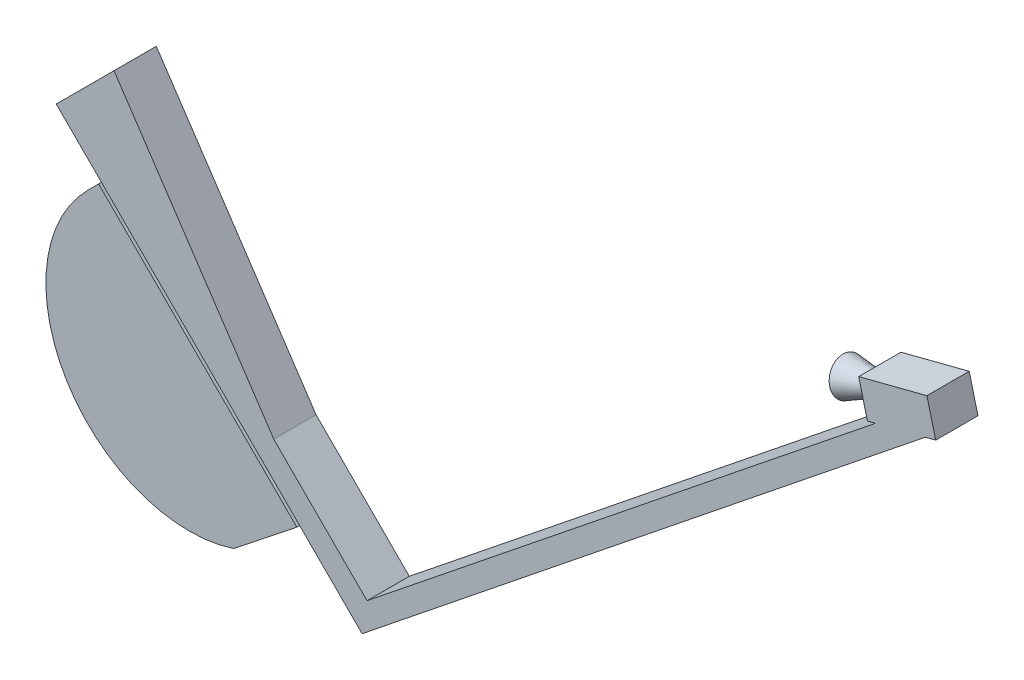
ISO-10303-21;
HEADER;
FILE_DESCRIPTION(('STEP AP214'),'2;1');
FILE_NAME('part.step','',(''),(''),'','','');
FILE_SCHEMA(('AUTOMOTIVE_DESIGN { 1 0 10303 214 1 1 1 1 }'));
ENDSEC;
DATA;
#1=APPLICATION_CONTEXT('core data for automotive mechanical design processes');
#2=APPLICATION_PROTOCOL_DEFINITION('international standard','automotive_design',2000,#1);
#3=PRODUCT_CONTEXT('',#1,'mechanical');
#4=PRODUCT('Part','Part','',(#3));
#5=PRODUCT_RELATED_PRODUCT_CATEGORY('part','',(#4));
#6=PRODUCT_DEFINITION_FORMATION('','',#4);
#7=PRODUCT_DEFINITION_CONTEXT('part definition',#1,'design');
#8=PRODUCT_DEFINITION('design','',#6,#7);
#9=PRODUCT_DEFINITION_SHAPE('','',#8);
#10=(LENGTH_UNIT() NAMED_UNIT(*) SI_UNIT(.MILLI.,.METRE.));
#11=(NAMED_UNIT(*) PLANE_ANGLE_UNIT() SI_UNIT($,.RADIAN.));
#12=(NAMED_UNIT(*) SI_UNIT($,.STERADIAN.) SOLID_ANGLE_UNIT());
#13=UNCERTAINTY_MEASURE_WITH_UNIT(LENGTH_MEASURE(1.E-05),#10,'distance_accuracy_value','');
#14=(GEOMETRIC_REPRESENTATION_CONTEXT(3) GLOBAL_UNCERTAINTY_ASSIGNED_CONTEXT((#13)) GLOBAL_UNIT_ASSIGNED_CONTEXT((#10,
#11,#12)) REPRESENTATION_CONTEXT('',''));
#15=CARTESIAN_POINT('',(0.,0.,0.));
#16=DIRECTION('',(0.,0.,1.));
#17=DIRECTION('',(1.,0.,0.));
#18=AXIS2_PLACEMENT_3D('',#15,#16,#17);
#19=CARTESIAN_POINT('',(-310.477036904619,245.573361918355,43.1));
#20=DIRECTION('',(-0.707106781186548,-0.707106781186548,0.));
#21=DIRECTION('',(0.707106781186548,-0.707106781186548,0.));
#22=AXIS2_PLACEMENT_3D('',#19,#20,#21);
#23=PLANE('',#22);
#24=DIRECTION('',(-0.707106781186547,0.707106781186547,0.));
#25=VECTOR('',#24,1.);
#26=CARTESIAN_POINT('',(-310.477036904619,245.573361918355,38.1));
#27=LINE('',#26,#25);
#28=CARTESIAN_POINT('',(46.638646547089,-111.542321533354,38.1));
#29=VERTEX_POINT('',#28);
#30=CARTESIAN_POINT('',(-310.477036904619,245.573361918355,38.1));
#31=VERTEX_POINT('',#30);
#32=EDGE_CURVE('E116',#29,#31,#27,.T.);
#33=ORIENTED_EDGE('',*,*,#32,.T.);
#34=DIRECTION('',(0.,0.,-1.));
#35=VECTOR('',#34,1.);
#36=CARTESIAN_POINT('',(-310.477036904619,245.573361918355,43.1));
#37=LINE('',#36,#35);
#38=CARTESIAN_POINT('',(-310.477036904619,245.573361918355,43.1));
#39=VERTEX_POINT('',#38);
#40=EDGE_CURVE('E12',#39,#31,#37,.T.);
#41=ORIENTED_EDGE('',*,*,#40,.F.);
#42=DIRECTION('',(-0.707106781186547,0.707106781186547,0.));
#43=VECTOR('',#42,1.);
#44=CARTESIAN_POINT('',(-310.477036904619,245.573361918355,43.1));
#45=LINE('',#44,#43);
#46=CARTESIAN_POINT('',(46.638646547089,-111.542321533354,43.1));
#47=VERTEX_POINT('',#46);
#48=EDGE_CURVE('E104',#47,#39,#45,.T.);
#49=ORIENTED_EDGE('',*,*,#48,.F.);
#50=DIRECTION('',(0.,0.,-1.));
#51=VECTOR('',#50,1.);
#52=CARTESIAN_POINT('',(46.638646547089,-111.542321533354,43.1));
#53=LINE('',#52,#51);
#54=EDGE_CURVE('E112',#47,#29,#53,.T.);
#55=ORIENTED_EDGE('',*,*,#54,.T.);
#56=EDGE_LOOP('',(#33,#41,#49,#55));
#57=FACE_BOUND('',#56,.T.);
#58=ADVANCED_FACE('F53',(#57),#23,.F.);
#59=CARTESIAN_POINT('',(-310.477036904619,245.573361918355,43.1));
#60=DIRECTION('',(0.707106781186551,-0.707106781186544,0.));
#61=DIRECTION('',(0.707106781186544,0.707106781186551,0.));
#62=AXIS2_PLACEMENT_3D('',#59,#60,#61);
#63=PLANE('',#62);
#64=DIRECTION('',(-0.707106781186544,-0.707106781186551,0.));
#65=VECTOR('',#64,1.);
#66=CARTESIAN_POINT('',(-310.477036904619,245.573361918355,38.1));
#67=LINE('',#66,#65);
#68=CARTESIAN_POINT('',(-329.965264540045,226.085134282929,38.1));
#69=VERTEX_POINT('',#68);
#70=EDGE_CURVE('E108',#31,#69,#67,.T.);
#71=ORIENTED_EDGE('',*,*,#70,.T.);
#72=DIRECTION('',(0.,0.,-1.));
#73=VECTOR('',#72,1.);
#74=CARTESIAN_POINT('',(-329.965264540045,226.085134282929,43.1));
#75=LINE('',#74,#73);
#76=CARTESIAN_POINT('',(-329.965264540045,226.085134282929,43.1));
#77=VERTEX_POINT('',#76);
#78=EDGE_CURVE('E61',#77,#69,#75,.T.);
#79=ORIENTED_EDGE('',*,*,#78,.F.);
#80=DIRECTION('',(-0.707106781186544,-0.707106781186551,0.));
#81=VECTOR('',#80,1.);
#82=CARTESIAN_POINT('',(-310.477036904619,245.573361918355,43.1));
#83=LINE('',#82,#81);
#84=EDGE_CURVE('E99',#39,#77,#83,.T.);
#85=ORIENTED_EDGE('',*,*,#84,.F.);
#86=ORIENTED_EDGE('',*,*,#40,.T.);
#87=EDGE_LOOP('',(#71,#79,#85,#86));
#88=FACE_BOUND('',#87,.T.);
#89=ADVANCED_FACE('F107',(#88),#63,.F.);
#90=CARTESIAN_POINT('',(-147.427990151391,43.5478598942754,43.1));
#91=DIRECTION('',(0.,0.,-1.));
#92=DIRECTION('',(-1.,0.,0.));
#93=AXIS2_PLACEMENT_3D('',#90,#91,#92);
#94=CYLINDRICAL_SURFACE('',#93,258.146689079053);
#95=CARTESIAN_POINT('',(-147.427990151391,43.5478598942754,38.1));
#96=DIRECTION('',(0.,0.,1.));
#97=DIRECTION('',(1.,0.,0.));
#98=AXIS2_PLACEMENT_3D('',#95,#96,#97);
#99=CIRCLE('',#98,258.146689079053);
#100=CARTESIAN_POINT('',(-67.2523356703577,-201.832615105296,38.1));
#101=VERTEX_POINT('',#100);
#102=EDGE_CURVE('E86',#69,#101,#99,.T.);
#103=ORIENTED_EDGE('',*,*,#102,.T.);
#104=DIRECTION('',(0.,0.,-1.));
#105=VECTOR('',#104,1.);
#106=CARTESIAN_POINT('',(-67.2523356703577,-201.832615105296,43.1));
#107=LINE('',#106,#105);
#108=CARTESIAN_POINT('',(-67.2523356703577,-201.832615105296,43.1));
#109=VERTEX_POINT('',#108);
#110=EDGE_CURVE('E109',#109,#101,#107,.T.);
#111=ORIENTED_EDGE('',*,*,#110,.F.);
#112=CARTESIAN_POINT('',(-147.427990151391,43.5478598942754,43.1));
#113=DIRECTION('',(0.,0.,1.));
#114=DIRECTION('',(1.,0.,0.));
#115=AXIS2_PLACEMENT_3D('',#112,#113,#114);
#116=CIRCLE('',#115,258.146689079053);
#117=EDGE_CURVE('E102',#77,#109,#116,.T.);
#118=ORIENTED_EDGE('',*,*,#117,.F.);
#119=ORIENTED_EDGE('',*,*,#78,.T.);
#120=EDGE_LOOP('',(#103,#111,#118,#119));
#121=FACE_BOUND('',#120,.T.);
#122=ADVANCED_FACE('F110',(#121),#94,.T.);
#123=CARTESIAN_POINT('',(-67.2523356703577,-201.832615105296,43.1));
#124=DIRECTION('',(-0.621238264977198,0.783621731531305,0.));
#125=DIRECTION('',(-0.783621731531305,-0.621238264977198,0.));
#126=AXIS2_PLACEMENT_3D('',#123,#124,#125);
#127=PLANE('',#126);
#128=DIRECTION('',(0.783621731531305,0.621238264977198,0.));
#129=VECTOR('',#128,1.);
#130=CARTESIAN_POINT('',(-67.2523356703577,-201.832615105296,38.1));
#131=LINE('',#130,#129);
#132=EDGE_CURVE('E92',#101,#29,#131,.T.);
#133=ORIENTED_EDGE('',*,*,#132,.T.);
#134=ORIENTED_EDGE('',*,*,#54,.F.);
#135=DIRECTION('',(0.783621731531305,0.621238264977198,0.));
#136=VECTOR('',#135,1.);
#137=CARTESIAN_POINT('',(-67.2523356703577,-201.832615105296,43.1));
#138=LINE('',#137,#136);
#139=EDGE_CURVE('E69',#109,#47,#138,.T.);
#140=ORIENTED_EDGE('',*,*,#139,.F.);
#141=ORIENTED_EDGE('',*,*,#110,.T.);
#142=EDGE_LOOP('',(#133,#134,#140,#141));
#143=FACE_BOUND('',#142,.T.);
#144=ADVANCED_FACE('F123',(#143),#127,.F.);
#145=CARTESIAN_POINT('',(-147.427990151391,43.5478598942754,43.1));
#146=DIRECTION('',(0.,0.,1.));
#147=DIRECTION('',(1.,0.,0.));
#148=AXIS2_PLACEMENT_3D('',#145,#146,#147);
#149=PLANE('',#148);
#150=ORIENTED_EDGE('',*,*,#48,.T.);
#151=ORIENTED_EDGE('',*,*,#84,.T.);
#152=ORIENTED_EDGE('',*,*,#117,.T.);
#153=ORIENTED_EDGE('',*,*,#139,.T.);
#154=EDGE_LOOP('',(#150,#151,#152,#153));
#155=FACE_BOUND('',#154,.T.);
#156=ADVANCED_FACE('F100',(#155),#149,.T.);
#157=CARTESIAN_POINT('',(-147.427990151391,43.5478598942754,38.1));
#158=DIRECTION('',(0.,0.,1.));
#159=DIRECTION('',(1.,0.,0.));
#160=AXIS2_PLACEMENT_3D('',#157,#158,#159);
#161=PLANE('',#160);
#162=ORIENTED_EDGE('',*,*,#32,.F.);
#163=ORIENTED_EDGE('',*,*,#132,.F.);
#164=ORIENTED_EDGE('',*,*,#102,.F.);
#165=ORIENTED_EDGE('',*,*,#70,.F.);
#166=EDGE_LOOP('',(#162,#163,#164,#165));
#167=FACE_BOUND('',#166,.T.);
#168=ADVANCED_FACE('F126',(#167),#161,.F.);
#169=CLOSED_SHELL('',(#58,#89,#122,#144,#156,#168));
#170=MANIFOLD_SOLID_BREP('B2',#169);
#171=CARTESIAN_POINT('',(-287.849814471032,431.100566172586,38.1));
#172=DIRECTION('',(-0.831649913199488,-0.555300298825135,0.));
#173=DIRECTION('',(0.555300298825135,-0.831649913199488,0.));
#174=AXIS2_PLACEMENT_3D('',#171,#172,#173);
#175=PLANE('',#174);
#176=DIRECTION('',(-0.555300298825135,0.831649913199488,0.));
#177=VECTOR('',#176,1.);
#178=CARTESIAN_POINT('',(-287.849814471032,431.100566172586,-38.1));
#179=LINE('',#178,#177);
#180=CARTESIAN_POINT('',(0.,0.,-38.1));
#181=VERTEX_POINT('',#180);
#182=CARTESIAN_POINT('',(-287.849814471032,431.100566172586,-38.1));
#183=VERTEX_POINT('',#182);
#184=EDGE_CURVE('E292',#181,#183,#179,.T.);
#185=ORIENTED_EDGE('',*,*,#184,.T.);
#186=DIRECTION('',(0.,0.,-1.));
#187=VECTOR('',#186,1.);
#188=CARTESIAN_POINT('',(-287.849814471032,431.100566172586,38.1));
#189=LINE('',#188,#187);
#190=CARTESIAN_POINT('',(-287.849814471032,431.100566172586,38.1));
#191=VERTEX_POINT('',#190);
#192=EDGE_CURVE('E185',#191,#183,#189,.T.);
#193=ORIENTED_EDGE('',*,*,#192,.F.);
#194=DIRECTION('',(-0.555300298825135,0.831649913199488,0.));
#195=VECTOR('',#194,1.);
#196=CARTESIAN_POINT('',(-287.849814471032,431.100566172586,38.1));
#197=LINE('',#196,#195);
#198=CARTESIAN_POINT('',(0.,0.,38.1));
#199=VERTEX_POINT('',#198);
#200=EDGE_CURVE('E313',#199,#191,#197,.T.);
#201=ORIENTED_EDGE('',*,*,#200,.F.);
#202=DIRECTION('',(0.,0.,-1.));
#203=VECTOR('',#202,1.);
#204=CARTESIAN_POINT('',(0.,0.,38.1));
#205=LINE('',#204,#203);
#206=EDGE_CURVE('E288',#199,#181,#205,.T.);
#207=ORIENTED_EDGE('',*,*,#206,.T.);
#208=EDGE_LOOP('',(#185,#193,#201,#207));
#209=FACE_BOUND('',#208,.T.);
#210=ADVANCED_FACE('F177',(#209),#175,.F.);
#211=CARTESIAN_POINT('',(-391.927027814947,327.023352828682,38.1));
#212=DIRECTION('',(0.707106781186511,-0.707106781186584,0.));
#213=DIRECTION('',(0.707106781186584,0.707106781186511,0.));
#214=AXIS2_PLACEMENT_3D('',#211,#212,#213);
#215=PLANE('',#214);
#216=DIRECTION('',(-0.707106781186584,-0.707106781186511,0.));
#217=VECTOR('',#216,1.);
#218=CARTESIAN_POINT('',(-391.927027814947,327.023352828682,-38.1));
#219=LINE('',#218,#217);
#220=CARTESIAN_POINT('',(-391.927027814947,327.023352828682,-38.1));
#221=VERTEX_POINT('',#220);
#222=EDGE_CURVE('E295',#183,#221,#219,.T.);
#223=ORIENTED_EDGE('',*,*,#222,.T.);
#224=DIRECTION('',(0.,0.,-1.));
#225=VECTOR('',#224,1.);
#226=CARTESIAN_POINT('',(-391.927027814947,327.023352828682,38.1));
#227=LINE('',#226,#225);
#228=CARTESIAN_POINT('',(-391.927027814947,327.023352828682,38.1));
#229=VERTEX_POINT('',#228);
#230=EDGE_CURVE('E332',#229,#221,#227,.T.);
#231=ORIENTED_EDGE('',*,*,#230,.F.);
#232=DIRECTION('',(-0.707106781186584,-0.707106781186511,0.));
#233=VECTOR('',#232,1.);
#234=CARTESIAN_POINT('',(-391.927027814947,327.023352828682,38.1));
#235=LINE('',#234,#233);
#236=EDGE_CURVE('E246',#191,#229,#235,.T.);
#237=ORIENTED_EDGE('',*,*,#236,.F.);
#238=ORIENTED_EDGE('',*,*,#192,.T.);
#239=EDGE_LOOP('',(#223,#231,#237,#238));
#240=FACE_BOUND('',#239,.T.);
#241=ADVANCED_FACE('F335',(#240),#215,.F.);
#242=CARTESIAN_POINT('',(159.136338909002,-224.040013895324,38.1));
#243=DIRECTION('',(0.707106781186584,0.707106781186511,0.));
#244=DIRECTION('',(-0.707106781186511,0.707106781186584,0.));
#245=AXIS2_PLACEMENT_3D('',#242,#243,#244);
#246=PLANE('',#245);
#247=DIRECTION('',(0.707106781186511,-0.707106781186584,0.));
#248=VECTOR('',#247,1.);
#249=CARTESIAN_POINT('',(159.136338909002,-224.040013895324,-38.1));
#250=LINE('',#249,#248);
#251=CARTESIAN_POINT('',(159.136338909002,-224.040013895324,-38.1));
#252=VERTEX_POINT('',#251);
#253=EDGE_CURVE('E298',#221,#252,#250,.T.);
#254=ORIENTED_EDGE('',*,*,#253,.T.);
#255=DIRECTION('',(0.,0.,-1.));
#256=VECTOR('',#255,1.);
#257=CARTESIAN_POINT('',(159.136338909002,-224.040013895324,38.1));
#258=LINE('',#257,#256);
#259=CARTESIAN_POINT('',(159.136338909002,-224.040013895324,38.1));
#260=VERTEX_POINT('',#259);
#261=EDGE_CURVE('E329',#260,#252,#258,.T.);
#262=ORIENTED_EDGE('',*,*,#261,.F.);
#263=DIRECTION('',(0.707106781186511,-0.707106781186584,0.));
#264=VECTOR('',#263,1.);
#265=CARTESIAN_POINT('',(159.136338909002,-224.040013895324,38.1));
#266=LINE('',#265,#264);
#267=EDGE_CURVE('E355',#229,#260,#266,.T.);
#268=ORIENTED_EDGE('',*,*,#267,.F.);
#269=ORIENTED_EDGE('',*,*,#230,.T.);
#270=EDGE_LOOP('',(#254,#262,#268,#269));
#271=FACE_BOUND('',#270,.T.);
#272=ADVANCED_FACE('F346',(#271),#246,.F.);
#273=CARTESIAN_POINT('',(1173.98031540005,590.005351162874,38.1));
#274=DIRECTION('',(-0.625711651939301,0.780054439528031,0.));
#275=DIRECTION('',(-0.780054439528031,-0.625711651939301,0.));
#276=AXIS2_PLACEMENT_3D('',#273,#274,#275);
#277=PLANE('',#276);
#278=DIRECTION('',(0.780054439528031,0.625711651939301,0.));
#279=VECTOR('',#278,1.);
#280=CARTESIAN_POINT('',(1173.98031540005,590.005351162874,-38.1));
#281=LINE('',#280,#279);
#282=CARTESIAN_POINT('',(1173.98031540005,590.005351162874,-38.1));
#283=VERTEX_POINT('',#282);
#284=EDGE_CURVE('E300',#252,#283,#281,.T.);
#285=ORIENTED_EDGE('',*,*,#284,.T.);
#286=DIRECTION('',(0.,0.,-1.));
#287=VECTOR('',#286,1.);
#288=CARTESIAN_POINT('',(1173.98031540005,590.005351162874,38.1));
#289=LINE('',#288,#287);
#290=CARTESIAN_POINT('',(1173.98031540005,590.005351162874,38.1));
#291=VERTEX_POINT('',#290);
#292=EDGE_CURVE('E326',#291,#283,#289,.T.);
#293=ORIENTED_EDGE('',*,*,#292,.F.);
#294=DIRECTION('',(0.780054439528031,0.625711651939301,0.));
#295=VECTOR('',#294,1.);
#296=CARTESIAN_POINT('',(1173.98031540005,590.005351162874,38.1));
#297=LINE('',#296,#295);
#298=EDGE_CURVE('E352',#260,#291,#297,.T.);
#299=ORIENTED_EDGE('',*,*,#298,.F.);
#300=ORIENTED_EDGE('',*,*,#261,.T.);
#301=EDGE_LOOP('',(#285,#293,#299,#300));
#302=FACE_BOUND('',#301,.T.);
#303=ADVANCED_FACE('F350',(#302),#277,.F.);
#304=CARTESIAN_POINT('',(1192.75491174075,594.850408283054,38.1));
#305=DIRECTION('',(-0.249878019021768,0.968277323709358,0.));
#306=DIRECTION('',(-0.968277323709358,-0.249878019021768,0.));
#307=AXIS2_PLACEMENT_3D('',#304,#305,#306);
#308=PLANE('',#307);
#309=DIRECTION('',(0.968277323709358,0.249878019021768,0.));
#310=VECTOR('',#309,1.);
#311=CARTESIAN_POINT('',(1192.75491174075,594.850408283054,-38.1));
#312=LINE('',#311,#310);
#313=CARTESIAN_POINT('',(1192.75491174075,594.850408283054,-38.1));
#314=VERTEX_POINT('',#313);
#315=EDGE_CURVE('E302',#283,#314,#312,.T.);
#316=ORIENTED_EDGE('',*,*,#315,.T.);
#317=DIRECTION('',(0.,0.,-1.));
#318=VECTOR('',#317,1.);
#319=CARTESIAN_POINT('',(1192.75491174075,594.850408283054,38.1));
#320=LINE('',#319,#318);
#321=CARTESIAN_POINT('',(1192.75491174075,594.850408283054,38.1));
#322=VERTEX_POINT('',#321);
#323=EDGE_CURVE('E323',#322,#314,#320,.T.);
#324=ORIENTED_EDGE('',*,*,#323,.F.);
#325=DIRECTION('',(0.968277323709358,0.249878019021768,0.));
#326=VECTOR('',#325,1.);
#327=CARTESIAN_POINT('',(1192.75491174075,594.850408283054,38.1));
#328=LINE('',#327,#326);
#329=EDGE_CURVE('E354',#291,#322,#328,.T.);
#330=ORIENTED_EDGE('',*,*,#329,.F.);
#331=ORIENTED_EDGE('',*,*,#292,.T.);
#332=EDGE_LOOP('',(#316,#324,#330,#331));
#333=FACE_BOUND('',#332,.T.);
#334=ADVANCED_FACE('F379',(#333),#308,.F.);
#335=CARTESIAN_POINT('',(1176.88765753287,656.336018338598,38.1));
#336=DIRECTION('',(-0.968277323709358,-0.24987801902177,0.));
#337=DIRECTION('',(0.24987801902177,-0.968277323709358,0.));
#338=AXIS2_PLACEMENT_3D('',#335,#336,#337);
#339=PLANE('',#338);
#340=DIRECTION('',(-0.24987801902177,0.968277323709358,0.));
#341=VECTOR('',#340,1.);
#342=CARTESIAN_POINT('',(1176.88765753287,656.336018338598,-38.1));
#343=LINE('',#342,#341);
#344=CARTESIAN_POINT('',(1176.88765753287,656.336018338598,-38.1));
#345=VERTEX_POINT('',#344);
#346=EDGE_CURVE('E304',#314,#345,#343,.T.);
#347=ORIENTED_EDGE('',*,*,#346,.T.);
#348=DIRECTION('',(0.,0.,-1.));
#349=VECTOR('',#348,1.);
#350=CARTESIAN_POINT('',(1176.88765753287,656.336018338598,38.1));
#351=LINE('',#350,#349);
#352=CARTESIAN_POINT('',(1176.88765753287,656.336018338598,38.1));
#353=VERTEX_POINT('',#352);
#354=EDGE_CURVE('E320',#353,#345,#351,.T.);
#355=ORIENTED_EDGE('',*,*,#354,.F.);
#356=DIRECTION('',(-0.24987801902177,0.968277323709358,0.));
#357=VECTOR('',#356,1.);
#358=CARTESIAN_POINT('',(1176.88765753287,656.336018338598,38.1));
#359=LINE('',#358,#357);
#360=EDGE_CURVE('E357',#322,#353,#359,.T.);
#361=ORIENTED_EDGE('',*,*,#360,.F.);
#362=ORIENTED_EDGE('',*,*,#323,.T.);
#363=EDGE_LOOP('',(#347,#355,#361,#362));
#364=FACE_BOUND('',#363,.T.);
#365=ADVANCED_FACE('F376',(#364),#339,.F.);
#366=CARTESIAN_POINT('',(1053.91643742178,624.601509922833,38.1));
#367=DIRECTION('',(0.249878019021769,-0.968277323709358,0.));
#368=DIRECTION('',(0.968277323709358,0.249878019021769,0.));
#369=AXIS2_PLACEMENT_3D('',#366,#367,#368);
#370=PLANE('',#369);
#371=DIRECTION('',(-0.968277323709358,-0.249878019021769,0.));
#372=VECTOR('',#371,1.);
#373=CARTESIAN_POINT('',(1053.91643742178,624.601509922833,-38.1));
#374=LINE('',#373,#372);
#375=CARTESIAN_POINT('',(1053.91643742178,624.601509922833,-38.1));
#376=VERTEX_POINT('',#375);
#377=EDGE_CURVE('E306',#345,#376,#374,.T.);
#378=ORIENTED_EDGE('',*,*,#377,.T.);
#379=DIRECTION('',(0.,0.,-1.));
#380=VECTOR('',#379,1.);
#381=CARTESIAN_POINT('',(1053.91643742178,624.601509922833,38.1));
#382=LINE('',#381,#380);
#383=CARTESIAN_POINT('',(1053.91643742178,624.601509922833,38.1));
#384=VERTEX_POINT('',#383);
#385=EDGE_CURVE('E317',#384,#376,#382,.T.);
#386=ORIENTED_EDGE('',*,*,#385,.F.);
#387=DIRECTION('',(-0.968277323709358,-0.249878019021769,0.));
#388=VECTOR('',#387,1.);
#389=CARTESIAN_POINT('',(1053.91643742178,624.601509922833,38.1));
#390=LINE('',#389,#388);
#391=EDGE_CURVE('E363',#353,#384,#390,.T.);
#392=ORIENTED_EDGE('',*,*,#391,.F.);
#393=ORIENTED_EDGE('',*,*,#354,.T.);
#394=EDGE_LOOP('',(#378,#386,#392,#393));
#395=FACE_BOUND('',#394,.T.);
#396=ADVANCED_FACE('F369',(#395),#370,.F.);
#397=CARTESIAN_POINT('',(1069.78369162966,563.115899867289,38.1));
#398=DIRECTION('',(0.968277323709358,0.249878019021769,0.));
#399=DIRECTION('',(-0.249878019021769,0.968277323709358,0.));
#400=AXIS2_PLACEMENT_3D('',#397,#398,#399);
#401=PLANE('',#400);
#402=CARTESIAN_POINT('',(1061.85006452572,593.858704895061,0.));
#403=DIRECTION('',(0.968277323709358,0.249878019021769,0.));
#404=DIRECTION('',(-0.249878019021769,0.968277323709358,0.));
#405=AXIS2_PLACEMENT_3D('',#402,#403,#404);
#406=CIRCLE('',#405,14.2670097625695);
#407=CARTESIAN_POINT('',(1058.28505238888,607.673126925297,0.));
#408=VERTEX_POINT('',#407);
#409=EDGE_CURVE('E51',#408,#408,#406,.F.);
#410=ORIENTED_EDGE('',*,*,#409,.F.);
#411=EDGE_LOOP('',(#410));
#412=FACE_BOUND('',#411,.T.);
#413=DIRECTION('',(0.249878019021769,-0.968277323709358,0.));
#414=VECTOR('',#413,1.);
#415=CARTESIAN_POINT('',(1069.78369162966,563.115899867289,-38.1));
#416=LINE('',#415,#414);
#417=CARTESIAN_POINT('',(1069.78369162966,563.115899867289,-38.1));
#418=VERTEX_POINT('',#417);
#419=EDGE_CURVE('E308',#376,#418,#416,.T.);
#420=ORIENTED_EDGE('',*,*,#419,.T.);
#421=DIRECTION('',(0.,0.,-1.));
#422=VECTOR('',#421,1.);
#423=CARTESIAN_POINT('',(1069.78369162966,563.115899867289,38.1));
#424=LINE('',#423,#422);
#425=CARTESIAN_POINT('',(1069.78369162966,563.115899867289,38.1));
#426=VERTEX_POINT('',#425);
#427=EDGE_CURVE('E283',#426,#418,#424,.T.);
#428=ORIENTED_EDGE('',*,*,#427,.F.);
#429=DIRECTION('',(0.249878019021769,-0.968277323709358,0.));
#430=VECTOR('',#429,1.);
#431=CARTESIAN_POINT('',(1069.78369162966,563.115899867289,38.1));
#432=LINE('',#431,#430);
#433=EDGE_CURVE('E274',#384,#426,#432,.T.);
#434=ORIENTED_EDGE('',*,*,#433,.F.);
#435=ORIENTED_EDGE('',*,*,#385,.T.);
#436=EDGE_LOOP('',(#420,#428,#434,#435));
#437=FACE_BOUND('',#436,.T.);
#438=ADVANCED_FACE('F373',(#412,#437),#401,.F.);
#439=CARTESIAN_POINT('',(1084.20805711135,566.83831676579,38.1));
#440=DIRECTION('',(-0.249878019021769,0.968277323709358,0.));
#441=DIRECTION('',(-0.968277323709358,-0.249878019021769,0.));
#442=AXIS2_PLACEMENT_3D('',#439,#440,#441);
#443=PLANE('',#442);
#444=DIRECTION('',(0.968277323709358,0.249878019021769,0.));
#445=VECTOR('',#444,1.);
#446=CARTESIAN_POINT('',(1084.20805711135,566.83831676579,-38.1));
#447=LINE('',#446,#445);
#448=CARTESIAN_POINT('',(1084.20805711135,566.83831676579,-38.1));
#449=VERTEX_POINT('',#448);
#450=EDGE_CURVE('E282',#418,#449,#447,.T.);
#451=ORIENTED_EDGE('',*,*,#450,.T.);
#452=DIRECTION('',(0.,0.,-1.));
#453=VECTOR('',#452,1.);
#454=CARTESIAN_POINT('',(1084.20805711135,566.83831676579,38.1));
#455=LINE('',#454,#453);
#456=CARTESIAN_POINT('',(1084.20805711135,566.83831676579,38.1));
#457=VERTEX_POINT('',#456);
#458=EDGE_CURVE('E279',#457,#449,#455,.T.);
#459=ORIENTED_EDGE('',*,*,#458,.F.);
#460=DIRECTION('',(0.968277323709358,0.249878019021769,0.));
#461=VECTOR('',#460,1.);
#462=CARTESIAN_POINT('',(1084.20805711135,566.83831676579,38.1));
#463=LINE('',#462,#461);
#464=EDGE_CURVE('E268',#426,#457,#463,.T.);
#465=ORIENTED_EDGE('',*,*,#464,.F.);
#466=ORIENTED_EDGE('',*,*,#427,.T.);
#467=EDGE_LOOP('',(#451,#459,#465,#466));
#468=FACE_BOUND('',#467,.T.);
#469=ADVANCED_FACE('F280',(#468),#443,.F.);
#470=CARTESIAN_POINT('',(168.048490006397,-168.048490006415,38.1));
#471=DIRECTION('',(0.625711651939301,-0.780054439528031,0.));
#472=DIRECTION('',(0.780054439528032,0.625711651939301,0.));
#473=AXIS2_PLACEMENT_3D('',#470,#471,#472);
#474=PLANE('',#473);
#475=DIRECTION('',(-0.780054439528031,-0.625711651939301,0.));
#476=VECTOR('',#475,1.);
#477=CARTESIAN_POINT('',(168.048490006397,-168.048490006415,-38.1));
#478=LINE('',#477,#476);
#479=CARTESIAN_POINT('',(168.048490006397,-168.048490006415,-38.1));
#480=VERTEX_POINT('',#479);
#481=EDGE_CURVE('E231',#449,#480,#478,.T.);
#482=ORIENTED_EDGE('',*,*,#481,.T.);
#483=DIRECTION('',(0.,0.,-1.));
#484=VECTOR('',#483,1.);
#485=CARTESIAN_POINT('',(168.048490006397,-168.048490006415,38.1));
#486=LINE('',#485,#484);
#487=CARTESIAN_POINT('',(168.048490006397,-168.048490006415,38.1));
#488=VERTEX_POINT('',#487);
#489=EDGE_CURVE('E284',#488,#480,#486,.T.);
#490=ORIENTED_EDGE('',*,*,#489,.F.);
#491=DIRECTION('',(-0.780054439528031,-0.625711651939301,0.));
#492=VECTOR('',#491,1.);
#493=CARTESIAN_POINT('',(168.048490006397,-168.048490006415,38.1));
#494=LINE('',#493,#492);
#495=EDGE_CURVE('E272',#457,#488,#494,.T.);
#496=ORIENTED_EDGE('',*,*,#495,.F.);
#497=ORIENTED_EDGE('',*,*,#458,.T.);
#498=EDGE_LOOP('',(#482,#490,#496,#497));
#499=FACE_BOUND('',#498,.T.);
#500=ADVANCED_FACE('F286',(#499),#474,.F.);
#501=CARTESIAN_POINT('',(0.,0.,38.1));
#502=DIRECTION('',(-0.707106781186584,-0.707106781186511,0.));
#503=DIRECTION('',(0.707106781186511,-0.707106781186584,0.));
#504=AXIS2_PLACEMENT_3D('',#501,#502,#503);
#505=PLANE('',#504);
#506=DIRECTION('',(-0.707106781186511,0.707106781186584,0.));
#507=VECTOR('',#506,1.);
#508=CARTESIAN_POINT('',(0.,0.,-38.1));
#509=LINE('',#508,#507);
#510=EDGE_CURVE('E237',#480,#181,#509,.T.);
#511=ORIENTED_EDGE('',*,*,#510,.T.);
#512=ORIENTED_EDGE('',*,*,#206,.F.);
#513=DIRECTION('',(-0.707106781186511,0.707106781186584,0.));
#514=VECTOR('',#513,1.);
#515=CARTESIAN_POINT('',(0.,0.,38.1));
#516=LINE('',#515,#514);
#517=EDGE_CURVE('E193',#488,#199,#516,.T.);
#518=ORIENTED_EDGE('',*,*,#517,.F.);
#519=ORIENTED_EDGE('',*,*,#489,.T.);
#520=EDGE_LOOP('',(#511,#512,#518,#519));
#521=FACE_BOUND('',#520,.T.);
#522=ADVANCED_FACE('F452',(#521),#505,.F.);
#523=CARTESIAN_POINT('',(0.,0.,38.1));
#524=DIRECTION('',(0.,0.,1.));
#525=DIRECTION('',(1.,0.,0.));
#526=AXIS2_PLACEMENT_3D('',#523,#524,#525);
#527=PLANE('',#526);
#528=ORIENTED_EDGE('',*,*,#200,.T.);
#529=ORIENTED_EDGE('',*,*,#236,.T.);
#530=ORIENTED_EDGE('',*,*,#267,.T.);
#531=ORIENTED_EDGE('',*,*,#298,.T.);
#532=ORIENTED_EDGE('',*,*,#329,.T.);
#533=ORIENTED_EDGE('',*,*,#360,.T.);
#534=ORIENTED_EDGE('',*,*,#391,.T.);
#535=ORIENTED_EDGE('',*,*,#433,.T.);
#536=ORIENTED_EDGE('',*,*,#464,.T.);
#537=ORIENTED_EDGE('',*,*,#495,.T.);
#538=ORIENTED_EDGE('',*,*,#517,.T.);
#539=EDGE_LOOP('',(#528,#529,#530,#531,#532,#533,#534,#535,#536,#537,#538));
#540=FACE_BOUND('',#539,.T.);
#541=ADVANCED_FACE('F270',(#540),#527,.T.);
#542=CARTESIAN_POINT('',(0.,0.,-38.1));
#543=DIRECTION('',(0.,0.,1.));
#544=DIRECTION('',(1.,0.,0.));
#545=AXIS2_PLACEMENT_3D('',#542,#543,#544);
#546=PLANE('',#545);
#547=ORIENTED_EDGE('',*,*,#184,.F.);
#548=ORIENTED_EDGE('',*,*,#510,.F.);
#549=ORIENTED_EDGE('',*,*,#481,.F.);
#550=ORIENTED_EDGE('',*,*,#450,.F.);
#551=ORIENTED_EDGE('',*,*,#419,.F.);
#552=ORIENTED_EDGE('',*,*,#377,.F.);
#553=ORIENTED_EDGE('',*,*,#346,.F.);
#554=ORIENTED_EDGE('',*,*,#315,.F.);
#555=ORIENTED_EDGE('',*,*,#284,.F.);
#556=ORIENTED_EDGE('',*,*,#253,.F.);
#557=ORIENTED_EDGE('',*,*,#222,.F.);
#558=EDGE_LOOP('',(#547,#548,#549,#550,#551,#552,#553,#554,#555,#556,#557));
#559=FACE_BOUND('',#558,.T.);
#560=ADVANCED_FACE('F340',(#559),#546,.F.);
#561=CARTESIAN_POINT('',(987.583181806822,607.673126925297,0.));
#562=DIRECTION('',(0.968277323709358,0.249878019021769,0.));
#563=DIRECTION('',(-0.249878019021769,0.968277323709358,0.));
#564=AXIS2_PLACEMENT_3D('',#561,#562,#563);
#565=PLANE('',#564);
#566=CARTESIAN_POINT('',(995.562749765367,576.752301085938,0.));
#567=DIRECTION('',(-0.968277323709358,-0.249878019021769,0.));
#568=DIRECTION('',(0.249878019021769,-0.968277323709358,0.));
#569=AXIS2_PLACEMENT_3D('',#566,#567,#568);
#570=CIRCLE('',#569,31.9338531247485);
#571=CARTESIAN_POINT('',(1003.54231772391,545.831475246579,0.));
#572=VERTEX_POINT('',#571);
#573=EDGE_CURVE('E296',#572,#572,#570,.T.);
#574=ORIENTED_EDGE('',*,*,#573,.T.);
#575=EDGE_LOOP('',(#574));
#576=FACE_BOUND('',#575,.T.);
#577=ADVANCED_FACE('F474',(#576),#565,.F.);
#578=CARTESIAN_POINT('',(1061.85006452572,593.858704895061,0.));
#579=DIRECTION('',(-0.968277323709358,-0.249878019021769,0.));
#580=DIRECTION('',(0.249878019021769,-0.968277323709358,0.));
#581=AXIS2_PLACEMENT_3D('',#578,#579,#580);
#582=CONICAL_SURFACE('',#581,14.2670097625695,0.252554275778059);
#583=ORIENTED_EDGE('',*,*,#573,.F.);
#584=EDGE_LOOP('',(#583));
#585=FACE_BOUND('',#584,.T.);
#586=ORIENTED_EDGE('',*,*,#409,.T.);
#587=EDGE_LOOP('',(#586));
#588=FACE_BOUND('',#587,.T.);
#589=ADVANCED_FACE('F482',(#585,#588),#582,.T.);
#590=CLOSED_SHELL('',(#210,#241,#272,#303,#334,#365,#396,#438,#469,#500,#522,#541,#560,#577,#589));
#591=MANIFOLD_SOLID_BREP('B6',#590);
#592=ADVANCED_BREP_SHAPE_REPRESENTATION('',(#18,#170,#591),#14);
#593=SHAPE_DEFINITION_REPRESENTATION(#9,#592);
ENDSEC;
END-ISO-10303-21;
